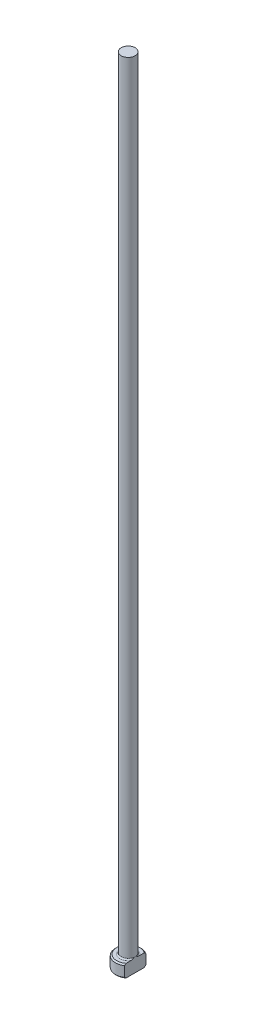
from build123d import *
from build123d.topology import SkipClean

# Parameters (mm, degrees)
CHAMFER1_SIZE = 0.2
FILLET1_R     = 0.2
KEY_DEPTH     = 126.031995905


with BuildPart() as part:
    # Sketch1 → Revolve1 (revolve)
    with BuildSketch(Plane.XY, mode=Mode.PRIVATE) as revolve1_sk:
        Polygon((0, 0), (-2, 0), (-2, 2), (-1.1, 2), (-1.1, 125), (0, 125), align=None)
    revolve(revolve1_sk.sketch.rotate(Axis((0, 259.958771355, 0), (0, -1, 0)), 270), axis=Axis((0, 259.958771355, 0), (0, -1, 0)))

    # Chamfer1
    chamfer1_edges = [part.edges().sort_by_distance(p)[0] for p in [
        (0, 2, -2),
        (0, 0, -2),
    ]]
    chamfer(chamfer1_edges, length=CHAMFER1_SIZE)

    # Fillet1
    fillet1_edges = [part.edges().sort_by_distance(p)[0] for p in [
        (0, 2, -1.1),
    ]]
    fillet(fillet1_edges, radius=FILLET1_R)

    # Sketch2 → KEY (cut, through all)
    with SkipClean():  # the faces are left unmerged after this step: merging them gives an invalid solid
        with BuildSketch(Plane(origin=(0, 0, 0), x_dir=(1, 0, 0), z_dir=(0, 1, 0))):
            with BuildLine():
                Line((1.1, 1.670329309), (1.1, -1.670329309))
                ThreePointArc((1.1, -1.670329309), (2, 0), (1.1, 1.670329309))
            make_face()
        extrude(amount=KEY_DEPTH, mode=Mode.SUBTRACT)


solid = part.part
